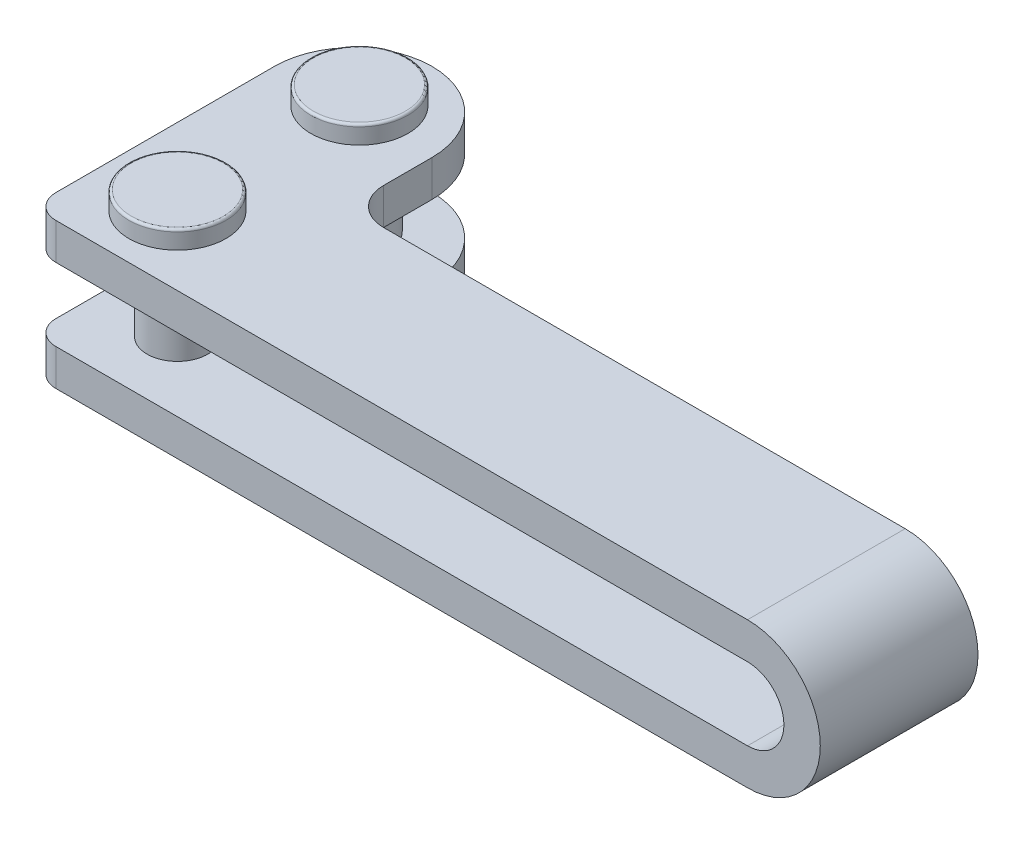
ISO-10303-21;
HEADER;
FILE_DESCRIPTION(('STEP AP214'),'2;1');
FILE_NAME('part.step','',(''),(''),'','','');
FILE_SCHEMA(('AUTOMOTIVE_DESIGN { 1 0 10303 214 1 1 1 1 }'));
ENDSEC;
DATA;
#1=APPLICATION_CONTEXT('core data for automotive mechanical design processes');
#2=APPLICATION_PROTOCOL_DEFINITION('international standard','automotive_design',2000,#1);
#3=PRODUCT_CONTEXT('',#1,'mechanical');
#4=PRODUCT('Part','Part','',(#3));
#5=PRODUCT_RELATED_PRODUCT_CATEGORY('part','',(#4));
#6=PRODUCT_DEFINITION_FORMATION('','',#4);
#7=PRODUCT_DEFINITION_CONTEXT('part definition',#1,'design');
#8=PRODUCT_DEFINITION('design','',#6,#7);
#9=PRODUCT_DEFINITION_SHAPE('','',#8);
#10=(LENGTH_UNIT() NAMED_UNIT(*) SI_UNIT(.MILLI.,.METRE.));
#11=(NAMED_UNIT(*) PLANE_ANGLE_UNIT() SI_UNIT($,.RADIAN.));
#12=(NAMED_UNIT(*) SI_UNIT($,.STERADIAN.) SOLID_ANGLE_UNIT());
#13=UNCERTAINTY_MEASURE_WITH_UNIT(LENGTH_MEASURE(1.E-05),#10,'distance_accuracy_value','');
#14=(GEOMETRIC_REPRESENTATION_CONTEXT(3) GLOBAL_UNCERTAINTY_ASSIGNED_CONTEXT((#13)) GLOBAL_UNIT_ASSIGNED_CONTEXT((#10,
#11,#12)) REPRESENTATION_CONTEXT('',''));
#15=CARTESIAN_POINT('',(0.,0.,0.));
#16=DIRECTION('',(0.,0.,1.));
#17=DIRECTION('',(1.,0.,0.));
#18=AXIS2_PLACEMENT_3D('',#15,#16,#17);
#19=CARTESIAN_POINT('',(0.,6.,0.));
#20=DIRECTION('',(0.,-1.,0.));
#21=DIRECTION('',(-0.079240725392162,0.,-0.996855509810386));
#22=AXIS2_PLACEMENT_3D('',#19,#20,#21);
#23=CYLINDRICAL_SURFACE('',#22,2.5);
#24=CARTESIAN_POINT('',(0.,-3.,0.));
#25=DIRECTION('',(0.,1.,0.));
#26=DIRECTION('',(-1.,0.,0.));
#27=AXIS2_PLACEMENT_3D('',#24,#25,#26);
#28=CIRCLE('',#27,2.5);
#29=CARTESIAN_POINT('',(-2.5,-3.,0.));
#30=VERTEX_POINT('',#29);
#31=EDGE_CURVE('E729',#30,#30,#28,.F.);
#32=ORIENTED_EDGE('',*,*,#31,.F.);
#33=EDGE_LOOP('',(#32));
#34=FACE_BOUND('',#33,.T.);
#35=CARTESIAN_POINT('',(0.,3.,0.));
#36=DIRECTION('',(0.,1.,0.));
#37=DIRECTION('',(-1.,0.,0.));
#38=AXIS2_PLACEMENT_3D('',#35,#36,#37);
#39=CIRCLE('',#38,2.5);
#40=CARTESIAN_POINT('',(-2.5,3.,0.));
#41=VERTEX_POINT('',#40);
#42=EDGE_CURVE('E216',#41,#41,#39,.F.);
#43=ORIENTED_EDGE('',*,*,#42,.T.);
#44=EDGE_LOOP('',(#43));
#45=FACE_BOUND('',#44,.T.);
#46=ADVANCED_FACE('F14',(#34,#45),#23,.T.);
#47=CARTESIAN_POINT('',(0.,-7.3,0.));
#48=DIRECTION('',(0.,1.,0.));
#49=DIRECTION('',(0.079240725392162,0.,0.996855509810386));
#50=AXIS2_PLACEMENT_3D('',#47,#48,#49);
#51=TOROIDAL_SURFACE('',#50,3.8,0.2);
#52=CARTESIAN_POINT('',(0.,-7.3,0.));
#53=DIRECTION('',(0.,1.,0.));
#54=DIRECTION('',(0.079240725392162,0.,0.996855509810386));
#55=AXIS2_PLACEMENT_3D('',#52,#53,#54);
#56=CIRCLE('',#55,4.);
#57=CARTESIAN_POINT('',(0.316962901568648,-7.3,3.98742203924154));
#58=VERTEX_POINT('',#57);
#59=EDGE_CURVE('E717',#58,#58,#56,.T.);
#60=ORIENTED_EDGE('',*,*,#59,.F.);
#61=EDGE_LOOP('',(#60));
#62=FACE_BOUND('',#61,.T.);
#63=CARTESIAN_POINT('',(0.,-7.5,0.));
#64=DIRECTION('',(0.,-1.,0.));
#65=DIRECTION('',(0.079240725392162,0.,0.996855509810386));
#66=AXIS2_PLACEMENT_3D('',#63,#64,#65);
#67=CIRCLE('',#66,3.8);
#68=CARTESIAN_POINT('',(0.301114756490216,-7.5,3.78805093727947));
#69=VERTEX_POINT('',#68);
#70=EDGE_CURVE('E705',#69,#69,#67,.T.);
#71=ORIENTED_EDGE('',*,*,#70,.F.);
#72=EDGE_LOOP('',(#71));
#73=FACE_BOUND('',#72,.T.);
#74=ADVANCED_FACE('F600',(#62,#73),#51,.T.);
#75=CARTESIAN_POINT('',(0.,-6.,0.));
#76=DIRECTION('',(0.,-1.,0.));
#77=DIRECTION('',(-0.079240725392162,0.,-0.996855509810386));
#78=AXIS2_PLACEMENT_3D('',#75,#76,#77);
#79=CYLINDRICAL_SURFACE('',#78,4.);
#80=ORIENTED_EDGE('',*,*,#59,.T.);
#81=EDGE_LOOP('',(#80));
#82=FACE_BOUND('',#81,.T.);
#83=CARTESIAN_POINT('',(0.,-6.,0.));
#84=DIRECTION('',(0.,1.,0.));
#85=DIRECTION('',(0.079240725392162,0.,0.996855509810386));
#86=AXIS2_PLACEMENT_3D('',#83,#84,#85);
#87=CIRCLE('',#86,4.);
#88=CARTESIAN_POINT('',(0.316962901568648,-6.,3.98742203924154));
#89=VERTEX_POINT('',#88);
#90=EDGE_CURVE('E710',#89,#89,#87,.T.);
#91=ORIENTED_EDGE('',*,*,#90,.F.);
#92=EDGE_LOOP('',(#91));
#93=FACE_BOUND('',#92,.T.);
#94=ADVANCED_FACE('F245',(#82,#93),#79,.T.);
#95=CARTESIAN_POINT('',(0.,-7.5,0.));
#96=DIRECTION('',(0.,1.,0.));
#97=DIRECTION('',(0.079240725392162,0.,0.996855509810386));
#98=AXIS2_PLACEMENT_3D('',#95,#96,#97);
#99=PLANE('',#98);
#100=ORIENTED_EDGE('',*,*,#70,.T.);
#101=EDGE_LOOP('',(#100));
#102=FACE_BOUND('',#101,.T.);
#103=ADVANCED_FACE('F236',(#102),#99,.F.);
#104=CARTESIAN_POINT('',(55.2,49.7831853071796,7.71));
#105=DIRECTION('',(0.,0.,1.));
#106=DIRECTION('',(0.,1.,0.));
#107=AXIS2_PLACEMENT_3D('',#104,#105,#106);
#108=PLANE('',#107);
#109=DIRECTION('',(1.,0.,0.));
#110=VECTOR('',#109,1.);
#111=CARTESIAN_POINT('',(9.7,-3.,7.71));
#112=LINE('',#111,#110);
#113=CARTESIAN_POINT('',(9.7,-3.,7.71));
#114=VERTEX_POINT('',#113);
#115=CARTESIAN_POINT('',(52.7,-3.,7.71));
#116=VERTEX_POINT('',#115);
#117=EDGE_CURVE('E191',#114,#116,#112,.T.);
#118=ORIENTED_EDGE('',*,*,#117,.T.);
#119=CARTESIAN_POINT('',(52.7,0.,7.71));
#120=DIRECTION('',(0.,0.,1.));
#121=DIRECTION('',(1.,0.,0.));
#122=AXIS2_PLACEMENT_3D('',#119,#120,#121);
#123=CIRCLE('',#122,3.);
#124=CARTESIAN_POINT('',(52.7,3.,7.71));
#125=VERTEX_POINT('',#124);
#126=EDGE_CURVE('E1031',#116,#125,#123,.T.);
#127=ORIENTED_EDGE('',*,*,#126,.T.);
#128=DIRECTION('',(1.,0.,0.));
#129=VECTOR('',#128,1.);
#130=CARTESIAN_POINT('',(9.7,3.,7.71));
#131=LINE('',#130,#129);
#132=CARTESIAN_POINT('',(9.7,3.,7.71));
#133=VERTEX_POINT('',#132);
#134=EDGE_CURVE('E386',#133,#125,#131,.T.);
#135=ORIENTED_EDGE('',*,*,#134,.F.);
#136=DIRECTION('',(0.,1.,0.));
#137=VECTOR('',#136,1.);
#138=CARTESIAN_POINT('',(9.7,3.,7.71));
#139=LINE('',#138,#137);
#140=CARTESIAN_POINT('',(9.7,6.,7.71));
#141=VERTEX_POINT('',#140);
#142=EDGE_CURVE('E37',#133,#141,#139,.T.);
#143=ORIENTED_EDGE('',*,*,#142,.T.);
#144=DIRECTION('',(1.,0.,0.));
#145=VECTOR('',#144,1.);
#146=CARTESIAN_POINT('',(9.7,6.,7.71));
#147=LINE('',#146,#145);
#148=CARTESIAN_POINT('',(52.7,6.,7.71));
#149=VERTEX_POINT('',#148);
#150=EDGE_CURVE('E397',#141,#149,#147,.T.);
#151=ORIENTED_EDGE('',*,*,#150,.T.);
#152=CARTESIAN_POINT('',(52.7,0.,7.71));
#153=DIRECTION('',(0.,0.,1.));
#154=DIRECTION('',(1.,0.,0.));
#155=AXIS2_PLACEMENT_3D('',#152,#153,#154);
#156=CIRCLE('',#155,6.);
#157=CARTESIAN_POINT('',(52.7,-6.,7.71));
#158=VERTEX_POINT('',#157);
#159=EDGE_CURVE('E192',#149,#158,#156,.F.);
#160=ORIENTED_EDGE('',*,*,#159,.T.);
#161=DIRECTION('',(1.,0.,0.));
#162=VECTOR('',#161,1.);
#163=CARTESIAN_POINT('',(9.7,-6.,7.71));
#164=LINE('',#163,#162);
#165=CARTESIAN_POINT('',(9.7,-6.,7.71));
#166=VERTEX_POINT('',#165);
#167=EDGE_CURVE('E168',#166,#158,#164,.T.);
#168=ORIENTED_EDGE('',*,*,#167,.F.);
#169=DIRECTION('',(0.,1.,0.));
#170=VECTOR('',#169,1.);
#171=CARTESIAN_POINT('',(9.7,-6.,7.71));
#172=LINE('',#171,#170);
#173=EDGE_CURVE('E163',#166,#114,#172,.T.);
#174=ORIENTED_EDGE('',*,*,#173,.T.);
#175=EDGE_LOOP('',(#118,#127,#135,#143,#151,#160,#168,#174));
#176=FACE_BOUND('',#175,.T.);
#177=ADVANCED_FACE('F233',(#176),#108,.F.);
#178=CARTESIAN_POINT('',(55.2,63.7831853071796,20.71));
#179=DIRECTION('',(0.,0.,-1.));
#180=DIRECTION('',(1.,0.,0.));
#181=AXIS2_PLACEMENT_3D('',#178,#179,#180);
#182=PLANE('',#181);
#183=DIRECTION('',(-1.,0.,0.));
#184=VECTOR('',#183,1.);
#185=CARTESIAN_POINT('',(-4.3,3.,20.71));
#186=LINE('',#185,#184);
#187=CARTESIAN_POINT('',(52.7,3.,20.71));
#188=VERTEX_POINT('',#187);
#189=CARTESIAN_POINT('',(-4.3,3.,20.71));
#190=VERTEX_POINT('',#189);
#191=EDGE_CURVE('E410',#188,#190,#186,.T.);
#192=ORIENTED_EDGE('',*,*,#191,.F.);
#193=CARTESIAN_POINT('',(52.7,0.,20.71));
#194=DIRECTION('',(0.,0.,-1.));
#195=DIRECTION('',(1.,0.,0.));
#196=AXIS2_PLACEMENT_3D('',#193,#194,#195);
#197=CIRCLE('',#196,3.);
#198=CARTESIAN_POINT('',(52.7,-3.,20.71));
#199=VERTEX_POINT('',#198);
#200=EDGE_CURVE('E1035',#188,#199,#197,.T.);
#201=ORIENTED_EDGE('',*,*,#200,.T.);
#202=DIRECTION('',(-1.,0.,0.));
#203=VECTOR('',#202,1.);
#204=CARTESIAN_POINT('',(-4.3,-3.,20.71));
#205=LINE('',#204,#203);
#206=CARTESIAN_POINT('',(-4.3,-3.,20.71));
#207=VERTEX_POINT('',#206);
#208=EDGE_CURVE('E165',#199,#207,#205,.T.);
#209=ORIENTED_EDGE('',*,*,#208,.T.);
#210=DIRECTION('',(0.,1.,0.));
#211=VECTOR('',#210,1.);
#212=CARTESIAN_POINT('',(-4.3,-6.,20.71));
#213=LINE('',#212,#211);
#214=CARTESIAN_POINT('',(-4.3,-6.,20.71));
#215=VERTEX_POINT('',#214);
#216=EDGE_CURVE('E153',#215,#207,#213,.T.);
#217=ORIENTED_EDGE('',*,*,#216,.F.);
#218=DIRECTION('',(-1.,0.,0.));
#219=VECTOR('',#218,1.);
#220=CARTESIAN_POINT('',(-4.3,-6.,20.71));
#221=LINE('',#220,#219);
#222=CARTESIAN_POINT('',(52.7,-6.,20.71));
#223=VERTEX_POINT('',#222);
#224=EDGE_CURVE('E159',#223,#215,#221,.T.);
#225=ORIENTED_EDGE('',*,*,#224,.F.);
#226=CARTESIAN_POINT('',(52.7,0.,20.71));
#227=DIRECTION('',(0.,0.,1.));
#228=DIRECTION('',(1.,0.,0.));
#229=AXIS2_PLACEMENT_3D('',#226,#227,#228);
#230=CIRCLE('',#229,6.);
#231=CARTESIAN_POINT('',(52.7,6.,20.71));
#232=VERTEX_POINT('',#231);
#233=EDGE_CURVE('E1038',#223,#232,#230,.T.);
#234=ORIENTED_EDGE('',*,*,#233,.T.);
#235=DIRECTION('',(-1.,0.,0.));
#236=VECTOR('',#235,1.);
#237=CARTESIAN_POINT('',(-4.3,6.,20.71));
#238=LINE('',#237,#236);
#239=CARTESIAN_POINT('',(-4.3,6.,20.71));
#240=VERTEX_POINT('',#239);
#241=EDGE_CURVE('E391',#232,#240,#238,.T.);
#242=ORIENTED_EDGE('',*,*,#241,.T.);
#243=DIRECTION('',(0.,1.,0.));
#244=VECTOR('',#243,1.);
#245=CARTESIAN_POINT('',(-4.3,3.,20.71));
#246=LINE('',#245,#244);
#247=EDGE_CURVE('E406',#190,#240,#246,.T.);
#248=ORIENTED_EDGE('',*,*,#247,.F.);
#249=EDGE_LOOP('',(#192,#201,#209,#217,#225,#234,#242,#248));
#250=FACE_BOUND('',#249,.T.);
#251=ADVANCED_FACE('F235',(#250),#182,.F.);
#252=CARTESIAN_POINT('',(0.,-7.5,15.));
#253=DIRECTION('',(0.,1.,0.));
#254=DIRECTION('',(0.819710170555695,0.,0.572778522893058));
#255=AXIS2_PLACEMENT_3D('',#252,#253,#254);
#256=PLANE('',#255);
#257=CARTESIAN_POINT('',(0.,-7.5,15.));
#258=DIRECTION('',(0.,-1.,0.));
#259=DIRECTION('',(0.819710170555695,0.,0.572778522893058));
#260=AXIS2_PLACEMENT_3D('',#257,#258,#259);
#261=CIRCLE('',#260,3.8);
#262=CARTESIAN_POINT('',(3.11489864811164,-7.5,17.1765583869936));
#263=VERTEX_POINT('',#262);
#264=EDGE_CURVE('E430',#263,#263,#261,.T.);
#265=ORIENTED_EDGE('',*,*,#264,.T.);
#266=EDGE_LOOP('',(#265));
#267=FACE_BOUND('',#266,.T.);
#268=ADVANCED_FACE('F242',(#267),#256,.F.);
#269=CARTESIAN_POINT('',(0.,-7.3,15.));
#270=DIRECTION('',(0.,1.,0.));
#271=DIRECTION('',(0.819710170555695,0.,0.572778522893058));
#272=AXIS2_PLACEMENT_3D('',#269,#270,#271);
#273=TOROIDAL_SURFACE('',#272,3.8,0.2);
#274=CARTESIAN_POINT('',(0.,-7.3,15.));
#275=DIRECTION('',(0.,1.,0.));
#276=DIRECTION('',(0.819710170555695,0.,0.572778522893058));
#277=AXIS2_PLACEMENT_3D('',#274,#275,#276);
#278=CIRCLE('',#277,4.);
#279=CARTESIAN_POINT('',(3.27884068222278,-7.3,17.2911140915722));
#280=VERTEX_POINT('',#279);
#281=EDGE_CURVE('E748',#280,#280,#278,.T.);
#282=ORIENTED_EDGE('',*,*,#281,.F.);
#283=EDGE_LOOP('',(#282));
#284=FACE_BOUND('',#283,.T.);
#285=ORIENTED_EDGE('',*,*,#264,.F.);
#286=EDGE_LOOP('',(#285));
#287=FACE_BOUND('',#286,.T.);
#288=ADVANCED_FACE('F639',(#284,#287),#273,.T.);
#289=CARTESIAN_POINT('',(0.,6.,15.));
#290=DIRECTION('',(0.,-1.,0.));
#291=DIRECTION('',(-0.819710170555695,0.,-0.572778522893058));
#292=AXIS2_PLACEMENT_3D('',#289,#290,#291);
#293=CYLINDRICAL_SURFACE('',#292,2.5);
#294=CARTESIAN_POINT('',(0.,-3.,15.));
#295=DIRECTION('',(0.,1.,0.));
#296=DIRECTION('',(-1.,0.,0.));
#297=AXIS2_PLACEMENT_3D('',#294,#295,#296);
#298=CIRCLE('',#297,2.5);
#299=CARTESIAN_POINT('',(-2.5,-3.,15.));
#300=VERTEX_POINT('',#299);
#301=EDGE_CURVE('E711',#300,#300,#298,.F.);
#302=ORIENTED_EDGE('',*,*,#301,.F.);
#303=EDGE_LOOP('',(#302));
#304=FACE_BOUND('',#303,.T.);
#305=CARTESIAN_POINT('',(0.,3.,15.));
#306=DIRECTION('',(0.,-1.,0.));
#307=DIRECTION('',(0.,0.,-1.));
#308=AXIS2_PLACEMENT_3D('',#305,#306,#307);
#309=CIRCLE('',#308,2.5);
#310=CARTESIAN_POINT('',(0.,3.,12.5));
#311=VERTEX_POINT('',#310);
#312=EDGE_CURVE('E760',#311,#311,#309,.T.);
#313=ORIENTED_EDGE('',*,*,#312,.T.);
#314=EDGE_LOOP('',(#313));
#315=FACE_BOUND('',#314,.T.);
#316=ADVANCED_FACE('F279',(#304,#315),#293,.T.);
#317=CARTESIAN_POINT('',(-4.3,-6.,18.71));
#318=DIRECTION('',(0.,1.,0.));
#319=DIRECTION('',(0.,0.,1.));
#320=AXIS2_PLACEMENT_3D('',#317,#318,#319);
#321=CYLINDRICAL_SURFACE('',#320,2.);
#322=CARTESIAN_POINT('',(-4.3,-3.,18.71));
#323=DIRECTION('',(0.,-1.,0.));
#324=DIRECTION('',(0.,0.,-1.));
#325=AXIS2_PLACEMENT_3D('',#322,#323,#324);
#326=CIRCLE('',#325,2.);
#327=CARTESIAN_POINT('',(-6.3,-3.,18.71));
#328=VERTEX_POINT('',#327);
#329=EDGE_CURVE('E135',#207,#328,#326,.T.);
#330=ORIENTED_EDGE('',*,*,#329,.T.);
#331=DIRECTION('',(0.,1.,0.));
#332=VECTOR('',#331,1.);
#333=CARTESIAN_POINT('',(-6.3,-6.,18.71));
#334=LINE('',#333,#332);
#335=CARTESIAN_POINT('',(-6.3,-6.,18.71));
#336=VERTEX_POINT('',#335);
#337=EDGE_CURVE('E124',#336,#328,#334,.T.);
#338=ORIENTED_EDGE('',*,*,#337,.F.);
#339=CARTESIAN_POINT('',(-4.3,-6.,18.71));
#340=DIRECTION('',(0.,-1.,0.));
#341=DIRECTION('',(0.,0.,-1.));
#342=AXIS2_PLACEMENT_3D('',#339,#340,#341);
#343=CIRCLE('',#342,2.);
#344=EDGE_CURVE('E194',#215,#336,#343,.T.);
#345=ORIENTED_EDGE('',*,*,#344,.F.);
#346=ORIENTED_EDGE('',*,*,#216,.T.);
#347=EDGE_LOOP('',(#330,#338,#345,#346));
#348=FACE_BOUND('',#347,.T.);
#349=ADVANCED_FACE('F151',(#348),#321,.T.);
#350=CARTESIAN_POINT('',(-6.3,-6.,18.71));
#351=DIRECTION('',(1.,0.,0.));
#352=DIRECTION('',(0.,-1.,0.));
#353=AXIS2_PLACEMENT_3D('',#350,#351,#352);
#354=PLANE('',#353);
#355=DIRECTION('',(0.,0.,-1.));
#356=VECTOR('',#355,1.);
#357=CARTESIAN_POINT('',(-6.3,-3.,18.71));
#358=LINE('',#357,#356);
#359=CARTESIAN_POINT('',(-6.3,-3.,0.71));
#360=VERTEX_POINT('',#359);
#361=EDGE_CURVE('E128',#328,#360,#358,.T.);
#362=ORIENTED_EDGE('',*,*,#361,.T.);
#363=DIRECTION('',(0.,1.,0.));
#364=VECTOR('',#363,1.);
#365=CARTESIAN_POINT('',(-6.3,-6.,0.71));
#366=LINE('',#365,#364);
#367=CARTESIAN_POINT('',(-6.3,-6.,0.71));
#368=VERTEX_POINT('',#367);
#369=EDGE_CURVE('E148',#368,#360,#366,.T.);
#370=ORIENTED_EDGE('',*,*,#369,.F.);
#371=DIRECTION('',(0.,0.,-1.));
#372=VECTOR('',#371,1.);
#373=CARTESIAN_POINT('',(-6.3,-6.,18.71));
#374=LINE('',#373,#372);
#375=EDGE_CURVE('E130',#336,#368,#374,.T.);
#376=ORIENTED_EDGE('',*,*,#375,.F.);
#377=ORIENTED_EDGE('',*,*,#337,.T.);
#378=EDGE_LOOP('',(#362,#370,#376,#377));
#379=FACE_BOUND('',#378,.T.);
#380=ADVANCED_FACE('F126',(#379),#354,.F.);
#381=CARTESIAN_POINT('',(0.2,-6.,0.71));
#382=DIRECTION('',(0.,1.,0.));
#383=DIRECTION('',(0.,0.,1.));
#384=AXIS2_PLACEMENT_3D('',#381,#382,#383);
#385=CYLINDRICAL_SURFACE('',#384,6.5);
#386=CARTESIAN_POINT('',(0.2,-3.,0.71));
#387=DIRECTION('',(0.,-1.,0.));
#388=DIRECTION('',(0.,0.,-1.));
#389=AXIS2_PLACEMENT_3D('',#386,#387,#388);
#390=CIRCLE('',#389,6.5);
#391=CARTESIAN_POINT('',(6.7,-3.,0.71000000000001));
#392=VERTEX_POINT('',#391);
#393=EDGE_CURVE('E146',#360,#392,#390,.T.);
#394=ORIENTED_EDGE('',*,*,#393,.T.);
#395=DIRECTION('',(0.,1.,0.));
#396=VECTOR('',#395,1.);
#397=CARTESIAN_POINT('',(6.7,-6.,0.71000000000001));
#398=LINE('',#397,#396);
#399=CARTESIAN_POINT('',(6.7,-6.,0.71000000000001));
#400=VERTEX_POINT('',#399);
#401=EDGE_CURVE('E202',#400,#392,#398,.T.);
#402=ORIENTED_EDGE('',*,*,#401,.F.);
#403=CARTESIAN_POINT('',(0.2,-6.,0.71));
#404=DIRECTION('',(0.,-1.,0.));
#405=DIRECTION('',(0.,0.,-1.));
#406=AXIS2_PLACEMENT_3D('',#403,#404,#405);
#407=CIRCLE('',#406,6.5);
#408=EDGE_CURVE('E179',#368,#400,#407,.T.);
#409=ORIENTED_EDGE('',*,*,#408,.F.);
#410=ORIENTED_EDGE('',*,*,#369,.T.);
#411=EDGE_LOOP('',(#394,#402,#409,#410));
#412=FACE_BOUND('',#411,.T.);
#413=ADVANCED_FACE('F261',(#412),#385,.T.);
#414=CARTESIAN_POINT('',(6.7,-6.,4.71));
#415=DIRECTION('',(-1.,0.,0.));
#416=DIRECTION('',(0.,-1.,0.));
#417=AXIS2_PLACEMENT_3D('',#414,#415,#416);
#418=PLANE('',#417);
#419=DIRECTION('',(0.,0.,1.));
#420=VECTOR('',#419,1.);
#421=CARTESIAN_POINT('',(6.7,-3.,4.71));
#422=LINE('',#421,#420);
#423=CARTESIAN_POINT('',(6.7,-3.,4.71));
#424=VERTEX_POINT('',#423);
#425=EDGE_CURVE('E174',#392,#424,#422,.T.);
#426=ORIENTED_EDGE('',*,*,#425,.T.);
#427=DIRECTION('',(0.,1.,0.));
#428=VECTOR('',#427,1.);
#429=CARTESIAN_POINT('',(6.7,-6.,4.71));
#430=LINE('',#429,#428);
#431=CARTESIAN_POINT('',(6.7,-6.,4.71));
#432=VERTEX_POINT('',#431);
#433=EDGE_CURVE('E170',#432,#424,#430,.T.);
#434=ORIENTED_EDGE('',*,*,#433,.F.);
#435=DIRECTION('',(0.,0.,1.));
#436=VECTOR('',#435,1.);
#437=CARTESIAN_POINT('',(6.7,-6.,4.71));
#438=LINE('',#437,#436);
#439=EDGE_CURVE('E183',#400,#432,#438,.T.);
#440=ORIENTED_EDGE('',*,*,#439,.F.);
#441=ORIENTED_EDGE('',*,*,#401,.T.);
#442=EDGE_LOOP('',(#426,#434,#440,#441));
#443=FACE_BOUND('',#442,.T.);
#444=ADVANCED_FACE('F262',(#443),#418,.F.);
#445=CARTESIAN_POINT('',(9.7,-6.,4.71));
#446=DIRECTION('',(0.,1.,0.));
#447=DIRECTION('',(0.,0.,1.));
#448=AXIS2_PLACEMENT_3D('',#445,#446,#447);
#449=CYLINDRICAL_SURFACE('',#448,3.);
#450=CARTESIAN_POINT('',(9.7,-3.,4.71));
#451=DIRECTION('',(0.,1.,0.));
#452=DIRECTION('',(0.,0.,1.));
#453=AXIS2_PLACEMENT_3D('',#450,#451,#452);
#454=CIRCLE('',#453,3.);
#455=EDGE_CURVE('E173',#424,#114,#454,.T.);
#456=ORIENTED_EDGE('',*,*,#455,.T.);
#457=ORIENTED_EDGE('',*,*,#173,.F.);
#458=CARTESIAN_POINT('',(9.7,-6.,4.71));
#459=DIRECTION('',(0.,1.,0.));
#460=DIRECTION('',(0.,0.,1.));
#461=AXIS2_PLACEMENT_3D('',#458,#459,#460);
#462=CIRCLE('',#461,3.);
#463=EDGE_CURVE('E187',#432,#166,#462,.T.);
#464=ORIENTED_EDGE('',*,*,#463,.F.);
#465=ORIENTED_EDGE('',*,*,#433,.T.);
#466=EDGE_LOOP('',(#456,#457,#464,#465));
#467=FACE_BOUND('',#466,.T.);
#468=ADVANCED_FACE('F265',(#467),#449,.F.);
#469=CARTESIAN_POINT('',(9.7,-3.,4.71));
#470=DIRECTION('',(0.,1.,0.));
#471=DIRECTION('',(0.,0.,1.));
#472=AXIS2_PLACEMENT_3D('',#469,#470,#471);
#473=PLANE('',#472);
#474=ORIENTED_EDGE('',*,*,#208,.F.);
#475=DIRECTION('',(0.,0.,-1.));
#476=VECTOR('',#475,1.);
#477=CARTESIAN_POINT('',(52.7,-3.,4.71));
#478=LINE('',#477,#476);
#479=EDGE_CURVE('E169',#199,#116,#478,.T.);
#480=ORIENTED_EDGE('',*,*,#479,.T.);
#481=ORIENTED_EDGE('',*,*,#117,.F.);
#482=ORIENTED_EDGE('',*,*,#455,.F.);
#483=ORIENTED_EDGE('',*,*,#425,.F.);
#484=ORIENTED_EDGE('',*,*,#393,.F.);
#485=ORIENTED_EDGE('',*,*,#361,.F.);
#486=ORIENTED_EDGE('',*,*,#329,.F.);
#487=EDGE_LOOP('',(#474,#480,#481,#482,#483,#484,#485,#486));
#488=FACE_BOUND('',#487,.T.);
#489=ORIENTED_EDGE('',*,*,#301,.T.);
#490=EDGE_LOOP('',(#489));
#491=FACE_BOUND('',#490,.T.);
#492=ORIENTED_EDGE('',*,*,#31,.T.);
#493=EDGE_LOOP('',(#492));
#494=FACE_BOUND('',#493,.T.);
#495=ADVANCED_FACE('F141',(#488,#491,#494),#473,.T.);
#496=CARTESIAN_POINT('',(-4.3,3.,18.71));
#497=DIRECTION('',(0.,1.,0.));
#498=DIRECTION('',(0.,0.,1.));
#499=AXIS2_PLACEMENT_3D('',#496,#497,#498);
#500=CYLINDRICAL_SURFACE('',#499,2.);
#501=CARTESIAN_POINT('',(-4.3,6.,18.71));
#502=DIRECTION('',(0.,-1.,0.));
#503=DIRECTION('',(0.,0.,-1.));
#504=AXIS2_PLACEMENT_3D('',#501,#502,#503);
#505=CIRCLE('',#504,2.);
#506=CARTESIAN_POINT('',(-6.3,6.,18.71));
#507=VERTEX_POINT('',#506);
#508=EDGE_CURVE('E394',#240,#507,#505,.T.);
#509=ORIENTED_EDGE('',*,*,#508,.T.);
#510=DIRECTION('',(0.,1.,0.));
#511=VECTOR('',#510,1.);
#512=CARTESIAN_POINT('',(-6.3,3.,18.71));
#513=LINE('',#512,#511);
#514=CARTESIAN_POINT('',(-6.3,3.,18.71));
#515=VERTEX_POINT('',#514);
#516=EDGE_CURVE('E383',#515,#507,#513,.T.);
#517=ORIENTED_EDGE('',*,*,#516,.F.);
#518=CARTESIAN_POINT('',(-4.3,3.,18.71));
#519=DIRECTION('',(0.,-1.,0.));
#520=DIRECTION('',(0.,0.,-1.));
#521=AXIS2_PLACEMENT_3D('',#518,#519,#520);
#522=CIRCLE('',#521,2.);
#523=EDGE_CURVE('E414',#190,#515,#522,.T.);
#524=ORIENTED_EDGE('',*,*,#523,.F.);
#525=ORIENTED_EDGE('',*,*,#247,.T.);
#526=EDGE_LOOP('',(#509,#517,#524,#525));
#527=FACE_BOUND('',#526,.T.);
#528=ADVANCED_FACE('F257',(#527),#500,.T.);
#529=CARTESIAN_POINT('',(-6.3,3.,18.71));
#530=DIRECTION('',(1.,0.,0.));
#531=DIRECTION('',(0.,-1.,0.));
#532=AXIS2_PLACEMENT_3D('',#529,#530,#531);
#533=PLANE('',#532);
#534=DIRECTION('',(0.,0.,-1.));
#535=VECTOR('',#534,1.);
#536=CARTESIAN_POINT('',(-6.3,6.,18.71));
#537=LINE('',#536,#535);
#538=CARTESIAN_POINT('',(-6.3,6.,0.71));
#539=VERTEX_POINT('',#538);
#540=EDGE_CURVE('E372',#507,#539,#537,.T.);
#541=ORIENTED_EDGE('',*,*,#540,.T.);
#542=DIRECTION('',(0.,1.,0.));
#543=VECTOR('',#542,1.);
#544=CARTESIAN_POINT('',(-6.3,3.,0.71));
#545=LINE('',#544,#543);
#546=CARTESIAN_POINT('',(-6.3,3.,0.71));
#547=VERTEX_POINT('',#546);
#548=EDGE_CURVE('E366',#547,#539,#545,.T.);
#549=ORIENTED_EDGE('',*,*,#548,.F.);
#550=DIRECTION('',(0.,0.,-1.));
#551=VECTOR('',#550,1.);
#552=CARTESIAN_POINT('',(-6.3,3.,18.71));
#553=LINE('',#552,#551);
#554=EDGE_CURVE('E418',#515,#547,#553,.T.);
#555=ORIENTED_EDGE('',*,*,#554,.F.);
#556=ORIENTED_EDGE('',*,*,#516,.T.);
#557=EDGE_LOOP('',(#541,#549,#555,#556));
#558=FACE_BOUND('',#557,.T.);
#559=ADVANCED_FACE('F253',(#558),#533,.F.);
#560=CARTESIAN_POINT('',(0.2,3.,0.71));
#561=DIRECTION('',(0.,1.,0.));
#562=DIRECTION('',(0.,0.,1.));
#563=AXIS2_PLACEMENT_3D('',#560,#561,#562);
#564=CYLINDRICAL_SURFACE('',#563,6.5);
#565=CARTESIAN_POINT('',(0.2,6.,0.71));
#566=DIRECTION('',(0.,-1.,0.));
#567=DIRECTION('',(0.,0.,-1.));
#568=AXIS2_PLACEMENT_3D('',#565,#566,#567);
#569=CIRCLE('',#568,6.5);
#570=CARTESIAN_POINT('',(6.7,6.,0.71));
#571=VERTEX_POINT('',#570);
#572=EDGE_CURVE('E352',#539,#571,#569,.T.);
#573=ORIENTED_EDGE('',*,*,#572,.T.);
#574=DIRECTION('',(0.,1.,0.));
#575=VECTOR('',#574,1.);
#576=CARTESIAN_POINT('',(6.7,3.,0.71));
#577=LINE('',#576,#575);
#578=CARTESIAN_POINT('',(6.7,3.,0.71));
#579=VERTEX_POINT('',#578);
#580=EDGE_CURVE('E341',#579,#571,#577,.T.);
#581=ORIENTED_EDGE('',*,*,#580,.F.);
#582=CARTESIAN_POINT('',(0.2,3.,0.71));
#583=DIRECTION('',(0.,-1.,0.));
#584=DIRECTION('',(0.,0.,-1.));
#585=AXIS2_PLACEMENT_3D('',#582,#583,#584);
#586=CIRCLE('',#585,6.5);
#587=EDGE_CURVE('E376',#547,#579,#586,.T.);
#588=ORIENTED_EDGE('',*,*,#587,.F.);
#589=ORIENTED_EDGE('',*,*,#548,.T.);
#590=EDGE_LOOP('',(#573,#581,#588,#589));
#591=FACE_BOUND('',#590,.T.);
#592=ADVANCED_FACE('F256',(#591),#564,.T.);
#593=CARTESIAN_POINT('',(6.7,3.,4.71));
#594=DIRECTION('',(-1.,0.,0.));
#595=DIRECTION('',(0.,-1.,0.));
#596=AXIS2_PLACEMENT_3D('',#593,#594,#595);
#597=PLANE('',#596);
#598=DIRECTION('',(0.,0.,1.));
#599=VECTOR('',#598,1.);
#600=CARTESIAN_POINT('',(6.7,6.,4.71));
#601=LINE('',#600,#599);
#602=CARTESIAN_POINT('',(6.7,6.,4.71));
#603=VERTEX_POINT('',#602);
#604=EDGE_CURVE('E345',#571,#603,#601,.T.);
#605=ORIENTED_EDGE('',*,*,#604,.T.);
#606=DIRECTION('',(0.,1.,0.));
#607=VECTOR('',#606,1.);
#608=CARTESIAN_POINT('',(6.7,3.,4.71));
#609=LINE('',#608,#607);
#610=CARTESIAN_POINT('',(6.7,3.,4.71));
#611=VERTEX_POINT('',#610);
#612=EDGE_CURVE('E363',#611,#603,#609,.T.);
#613=ORIENTED_EDGE('',*,*,#612,.F.);
#614=DIRECTION('',(0.,0.,1.));
#615=VECTOR('',#614,1.);
#616=CARTESIAN_POINT('',(6.7,3.,4.71));
#617=LINE('',#616,#615);
#618=EDGE_CURVE('E347',#579,#611,#617,.T.);
#619=ORIENTED_EDGE('',*,*,#618,.F.);
#620=ORIENTED_EDGE('',*,*,#580,.T.);
#621=EDGE_LOOP('',(#605,#613,#619,#620));
#622=FACE_BOUND('',#621,.T.);
#623=ADVANCED_FACE('F343',(#622),#597,.F.);
#624=CARTESIAN_POINT('',(9.7,3.,4.71));
#625=DIRECTION('',(0.,1.,0.));
#626=DIRECTION('',(0.,0.,1.));
#627=AXIS2_PLACEMENT_3D('',#624,#625,#626);
#628=CYLINDRICAL_SURFACE('',#627,3.);
#629=CARTESIAN_POINT('',(9.7,6.,4.71));
#630=DIRECTION('',(0.,1.,0.));
#631=DIRECTION('',(0.,0.,1.));
#632=AXIS2_PLACEMENT_3D('',#629,#630,#631);
#633=CIRCLE('',#632,3.);
#634=EDGE_CURVE('E361',#603,#141,#633,.T.);
#635=ORIENTED_EDGE('',*,*,#634,.T.);
#636=ORIENTED_EDGE('',*,*,#142,.F.);
#637=CARTESIAN_POINT('',(9.7,3.,4.71));
#638=DIRECTION('',(0.,1.,0.));
#639=DIRECTION('',(0.,0.,1.));
#640=AXIS2_PLACEMENT_3D('',#637,#638,#639);
#641=CIRCLE('',#640,3.);
#642=EDGE_CURVE('E379',#611,#133,#641,.T.);
#643=ORIENTED_EDGE('',*,*,#642,.F.);
#644=ORIENTED_EDGE('',*,*,#612,.T.);
#645=EDGE_LOOP('',(#635,#636,#643,#644));
#646=FACE_BOUND('',#645,.T.);
#647=ADVANCED_FACE('F435',(#646),#628,.F.);
#648=CARTESIAN_POINT('',(9.7,6.,4.71));
#649=DIRECTION('',(0.,1.,0.));
#650=DIRECTION('',(0.,0.,1.));
#651=AXIS2_PLACEMENT_3D('',#648,#649,#650);
#652=PLANE('',#651);
#653=CARTESIAN_POINT('',(0.,6.,15.));
#654=DIRECTION('',(0.,1.,0.));
#655=DIRECTION('',(0.819710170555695,0.,0.572778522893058));
#656=AXIS2_PLACEMENT_3D('',#653,#654,#655);
#657=CIRCLE('',#656,4.);
#658=CARTESIAN_POINT('',(3.27884068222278,6.,17.2911140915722));
#659=VERTEX_POINT('',#658);
#660=EDGE_CURVE('E753',#659,#659,#657,.T.);
#661=ORIENTED_EDGE('',*,*,#660,.F.);
#662=EDGE_LOOP('',(#661));
#663=FACE_BOUND('',#662,.T.);
#664=ORIENTED_EDGE('',*,*,#241,.F.);
#665=DIRECTION('',(0.,0.,-1.));
#666=VECTOR('',#665,1.);
#667=CARTESIAN_POINT('',(52.7,6.,4.71));
#668=LINE('',#667,#666);
#669=EDGE_CURVE('E400',#232,#149,#668,.T.);
#670=ORIENTED_EDGE('',*,*,#669,.T.);
#671=ORIENTED_EDGE('',*,*,#150,.F.);
#672=ORIENTED_EDGE('',*,*,#634,.F.);
#673=ORIENTED_EDGE('',*,*,#604,.F.);
#674=ORIENTED_EDGE('',*,*,#572,.F.);
#675=ORIENTED_EDGE('',*,*,#540,.F.);
#676=ORIENTED_EDGE('',*,*,#508,.F.);
#677=EDGE_LOOP('',(#664,#670,#671,#672,#673,#674,#675,#676));
#678=FACE_BOUND('',#677,.T.);
#679=CARTESIAN_POINT('',(0.,6.,0.));
#680=DIRECTION('',(0.,1.,0.));
#681=DIRECTION('',(0.079240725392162,0.,0.996855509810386));
#682=AXIS2_PLACEMENT_3D('',#679,#680,#681);
#683=CIRCLE('',#682,4.);
#684=CARTESIAN_POINT('',(0.316962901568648,6.,3.98742203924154));
#685=VERTEX_POINT('',#684);
#686=EDGE_CURVE('E721',#685,#685,#683,.T.);
#687=ORIENTED_EDGE('',*,*,#686,.F.);
#688=EDGE_LOOP('',(#687));
#689=FACE_BOUND('',#688,.T.);
#690=ADVANCED_FACE('F252',(#663,#678,#689),#652,.T.);
#691=CARTESIAN_POINT('',(9.7,3.,4.71));
#692=DIRECTION('',(0.,1.,0.));
#693=DIRECTION('',(0.,0.,1.));
#694=AXIS2_PLACEMENT_3D('',#691,#692,#693);
#695=PLANE('',#694);
#696=DIRECTION('',(0.,0.,-1.));
#697=VECTOR('',#696,1.);
#698=CARTESIAN_POINT('',(52.7,3.,4.71));
#699=LINE('',#698,#697);
#700=EDGE_CURVE('E178',#188,#125,#699,.T.);
#701=ORIENTED_EDGE('',*,*,#700,.F.);
#702=ORIENTED_EDGE('',*,*,#191,.T.);
#703=ORIENTED_EDGE('',*,*,#523,.T.);
#704=ORIENTED_EDGE('',*,*,#554,.T.);
#705=ORIENTED_EDGE('',*,*,#587,.T.);
#706=ORIENTED_EDGE('',*,*,#618,.T.);
#707=ORIENTED_EDGE('',*,*,#642,.T.);
#708=ORIENTED_EDGE('',*,*,#134,.T.);
#709=EDGE_LOOP('',(#701,#702,#703,#704,#705,#706,#707,#708));
#710=FACE_BOUND('',#709,.T.);
#711=ORIENTED_EDGE('',*,*,#312,.F.);
#712=EDGE_LOOP('',(#711));
#713=FACE_BOUND('',#712,.T.);
#714=ORIENTED_EDGE('',*,*,#42,.F.);
#715=EDGE_LOOP('',(#714));
#716=FACE_BOUND('',#715,.T.);
#717=ADVANCED_FACE('F438',(#710,#713,#716),#695,.F.);
#718=CARTESIAN_POINT('',(0.,-6.,15.));
#719=DIRECTION('',(0.,-1.,0.));
#720=DIRECTION('',(-0.819710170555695,0.,-0.572778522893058));
#721=AXIS2_PLACEMENT_3D('',#718,#719,#720);
#722=CYLINDRICAL_SURFACE('',#721,4.);
#723=ORIENTED_EDGE('',*,*,#281,.T.);
#724=EDGE_LOOP('',(#723));
#725=FACE_BOUND('',#724,.T.);
#726=CARTESIAN_POINT('',(0.,-6.,15.));
#727=DIRECTION('',(0.,1.,0.));
#728=DIRECTION('',(0.819710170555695,0.,0.572778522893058));
#729=AXIS2_PLACEMENT_3D('',#726,#727,#728);
#730=CIRCLE('',#729,4.);
#731=CARTESIAN_POINT('',(3.27884068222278,-6.,17.2911140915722));
#732=VERTEX_POINT('',#731);
#733=EDGE_CURVE('E743',#732,#732,#730,.T.);
#734=ORIENTED_EDGE('',*,*,#733,.F.);
#735=EDGE_LOOP('',(#734));
#736=FACE_BOUND('',#735,.T.);
#737=ADVANCED_FACE('F270',(#725,#736),#722,.T.);
#738=CARTESIAN_POINT('',(9.7,-6.,4.71));
#739=DIRECTION('',(0.,1.,0.));
#740=DIRECTION('',(0.,0.,1.));
#741=AXIS2_PLACEMENT_3D('',#738,#739,#740);
#742=PLANE('',#741);
#743=ORIENTED_EDGE('',*,*,#733,.T.);
#744=EDGE_LOOP('',(#743));
#745=FACE_BOUND('',#744,.T.);
#746=DIRECTION('',(0.,0.,-1.));
#747=VECTOR('',#746,1.);
#748=CARTESIAN_POINT('',(52.7,-6.,4.71));
#749=LINE('',#748,#747);
#750=EDGE_CURVE('E188',#223,#158,#749,.T.);
#751=ORIENTED_EDGE('',*,*,#750,.F.);
#752=ORIENTED_EDGE('',*,*,#224,.T.);
#753=ORIENTED_EDGE('',*,*,#344,.T.);
#754=ORIENTED_EDGE('',*,*,#375,.T.);
#755=ORIENTED_EDGE('',*,*,#408,.T.);
#756=ORIENTED_EDGE('',*,*,#439,.T.);
#757=ORIENTED_EDGE('',*,*,#463,.T.);
#758=ORIENTED_EDGE('',*,*,#167,.T.);
#759=EDGE_LOOP('',(#751,#752,#753,#754,#755,#756,#757,#758));
#760=FACE_BOUND('',#759,.T.);
#761=ORIENTED_EDGE('',*,*,#90,.T.);
#762=EDGE_LOOP('',(#761));
#763=FACE_BOUND('',#762,.T.);
#764=ADVANCED_FACE('F267',(#745,#760,#763),#742,.F.);
#765=CARTESIAN_POINT('',(52.7,0.,-5.70640786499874));
#766=DIRECTION('',(0.,0.,1.));
#767=DIRECTION('',(1.,0.,0.));
#768=AXIS2_PLACEMENT_3D('',#765,#766,#767);
#769=CYLINDRICAL_SURFACE('',#768,6.);
#770=ORIENTED_EDGE('',*,*,#159,.F.);
#771=ORIENTED_EDGE('',*,*,#669,.F.);
#772=ORIENTED_EDGE('',*,*,#233,.F.);
#773=ORIENTED_EDGE('',*,*,#750,.T.);
#774=EDGE_LOOP('',(#770,#771,#772,#773));
#775=FACE_BOUND('',#774,.T.);
#776=ADVANCED_FACE('F248',(#775),#769,.T.);
#777=CARTESIAN_POINT('',(52.7,0.,-5.70640786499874));
#778=DIRECTION('',(0.,0.,1.));
#779=DIRECTION('',(1.,0.,0.));
#780=AXIS2_PLACEMENT_3D('',#777,#778,#779);
#781=CYLINDRICAL_SURFACE('',#780,3.);
#782=ORIENTED_EDGE('',*,*,#126,.F.);
#783=ORIENTED_EDGE('',*,*,#479,.F.);
#784=ORIENTED_EDGE('',*,*,#200,.F.);
#785=ORIENTED_EDGE('',*,*,#700,.T.);
#786=EDGE_LOOP('',(#782,#783,#784,#785));
#787=FACE_BOUND('',#786,.T.);
#788=ADVANCED_FACE('F965',(#787),#781,.F.);
#789=CARTESIAN_POINT('',(0.,7.5,0.));
#790=DIRECTION('',(0.,1.,0.));
#791=DIRECTION('',(0.,0.,1.));
#792=AXIS2_PLACEMENT_3D('',#789,#790,#791);
#793=PLANE('',#792);
#794=CARTESIAN_POINT('',(0.,7.5,0.));
#795=DIRECTION('',(0.,1.,0.));
#796=DIRECTION('',(0.,0.,1.));
#797=AXIS2_PLACEMENT_3D('',#794,#795,#796);
#798=CIRCLE('',#797,3.8);
#799=CARTESIAN_POINT('',(0.,7.5,3.8));
#800=VERTEX_POINT('',#799);
#801=EDGE_CURVE('E23',#800,#800,#798,.T.);
#802=ORIENTED_EDGE('',*,*,#801,.T.);
#803=EDGE_LOOP('',(#802));
#804=FACE_BOUND('',#803,.T.);
#805=ADVANCED_FACE('F221',(#804),#793,.T.);
#806=CARTESIAN_POINT('',(0.,7.5,0.));
#807=DIRECTION('',(0.,-1.,0.));
#808=DIRECTION('',(0.,0.,-1.));
#809=AXIS2_PLACEMENT_3D('',#806,#807,#808);
#810=CYLINDRICAL_SURFACE('',#809,4.);
#811=CARTESIAN_POINT('',(0.,7.3,0.));
#812=DIRECTION('',(0.,1.,0.));
#813=DIRECTION('',(0.,0.,1.));
#814=AXIS2_PLACEMENT_3D('',#811,#812,#813);
#815=CIRCLE('',#814,4.);
#816=CARTESIAN_POINT('',(0.,7.3,4.));
#817=VERTEX_POINT('',#816);
#818=EDGE_CURVE('E9',#817,#817,#815,.F.);
#819=ORIENTED_EDGE('',*,*,#818,.T.);
#820=EDGE_LOOP('',(#819));
#821=FACE_BOUND('',#820,.T.);
#822=ORIENTED_EDGE('',*,*,#686,.T.);
#823=EDGE_LOOP('',(#822));
#824=FACE_BOUND('',#823,.T.);
#825=ADVANCED_FACE('F980',(#821,#824),#810,.T.);
#826=CARTESIAN_POINT('',(0.,7.5,15.));
#827=DIRECTION('',(0.,1.,0.));
#828=DIRECTION('',(0.,0.,1.));
#829=AXIS2_PLACEMENT_3D('',#826,#827,#828);
#830=PLANE('',#829);
#831=CARTESIAN_POINT('',(0.,7.5,15.));
#832=DIRECTION('',(0.,1.,0.));
#833=DIRECTION('',(0.,0.,1.));
#834=AXIS2_PLACEMENT_3D('',#831,#832,#833);
#835=CIRCLE('',#834,3.8);
#836=CARTESIAN_POINT('',(0.,7.5,18.8));
#837=VERTEX_POINT('',#836);
#838=EDGE_CURVE('E212',#837,#837,#835,.T.);
#839=ORIENTED_EDGE('',*,*,#838,.T.);
#840=EDGE_LOOP('',(#839));
#841=FACE_BOUND('',#840,.T.);
#842=ADVANCED_FACE('F988',(#841),#830,.T.);
#843=CARTESIAN_POINT('',(0.,7.5,15.));
#844=DIRECTION('',(0.,-1.,0.));
#845=DIRECTION('',(0.,0.,-1.));
#846=AXIS2_PLACEMENT_3D('',#843,#844,#845);
#847=CYLINDRICAL_SURFACE('',#846,4.);
#848=CARTESIAN_POINT('',(0.,7.3,15.));
#849=DIRECTION('',(0.,1.,0.));
#850=DIRECTION('',(0.,0.,1.));
#851=AXIS2_PLACEMENT_3D('',#848,#849,#850);
#852=CIRCLE('',#851,4.);
#853=CARTESIAN_POINT('',(0.,7.3,19.));
#854=VERTEX_POINT('',#853);
#855=EDGE_CURVE('E215',#854,#854,#852,.F.);
#856=ORIENTED_EDGE('',*,*,#855,.T.);
#857=EDGE_LOOP('',(#856));
#858=FACE_BOUND('',#857,.T.);
#859=ORIENTED_EDGE('',*,*,#660,.T.);
#860=EDGE_LOOP('',(#859));
#861=FACE_BOUND('',#860,.T.);
#862=ADVANCED_FACE('F230',(#858,#861),#847,.T.);
#863=CARTESIAN_POINT('',(0.,7.3,15.));
#864=DIRECTION('',(0.,1.,0.));
#865=DIRECTION('',(0.,0.,1.));
#866=AXIS2_PLACEMENT_3D('',#863,#864,#865);
#867=TOROIDAL_SURFACE('',#866,3.8,0.2);
#868=ORIENTED_EDGE('',*,*,#855,.F.);
#869=EDGE_LOOP('',(#868));
#870=FACE_BOUND('',#869,.T.);
#871=ORIENTED_EDGE('',*,*,#838,.F.);
#872=EDGE_LOOP('',(#871));
#873=FACE_BOUND('',#872,.T.);
#874=ADVANCED_FACE('F224',(#870,#873),#867,.T.);
#875=CARTESIAN_POINT('',(0.,7.3,0.));
#876=DIRECTION('',(0.,1.,0.));
#877=DIRECTION('',(0.,0.,1.));
#878=AXIS2_PLACEMENT_3D('',#875,#876,#877);
#879=TOROIDAL_SURFACE('',#878,3.8,0.2);
#880=ORIENTED_EDGE('',*,*,#818,.F.);
#881=EDGE_LOOP('',(#880));
#882=FACE_BOUND('',#881,.T.);
#883=ORIENTED_EDGE('',*,*,#801,.F.);
#884=EDGE_LOOP('',(#883));
#885=FACE_BOUND('',#884,.T.);
#886=ADVANCED_FACE('F16',(#882,#885),#879,.T.);
#887=CLOSED_SHELL('',(#46,#74,#94,#103,#177,#251,#268,#288,#316,#349,#380,#413,#444,#468,#495,
#528,#559,#592,#623,#647,#690,#717,#737,#764,#776,#788,#805,#825,#842,#862,#874,#886));
#888=MANIFOLD_SOLID_BREP('B1',#887);
#889=ADVANCED_BREP_SHAPE_REPRESENTATION('',(#18,#888),#14);
#890=SHAPE_DEFINITION_REPRESENTATION(#9,#889);
ENDSEC;
END-ISO-10303-21;
